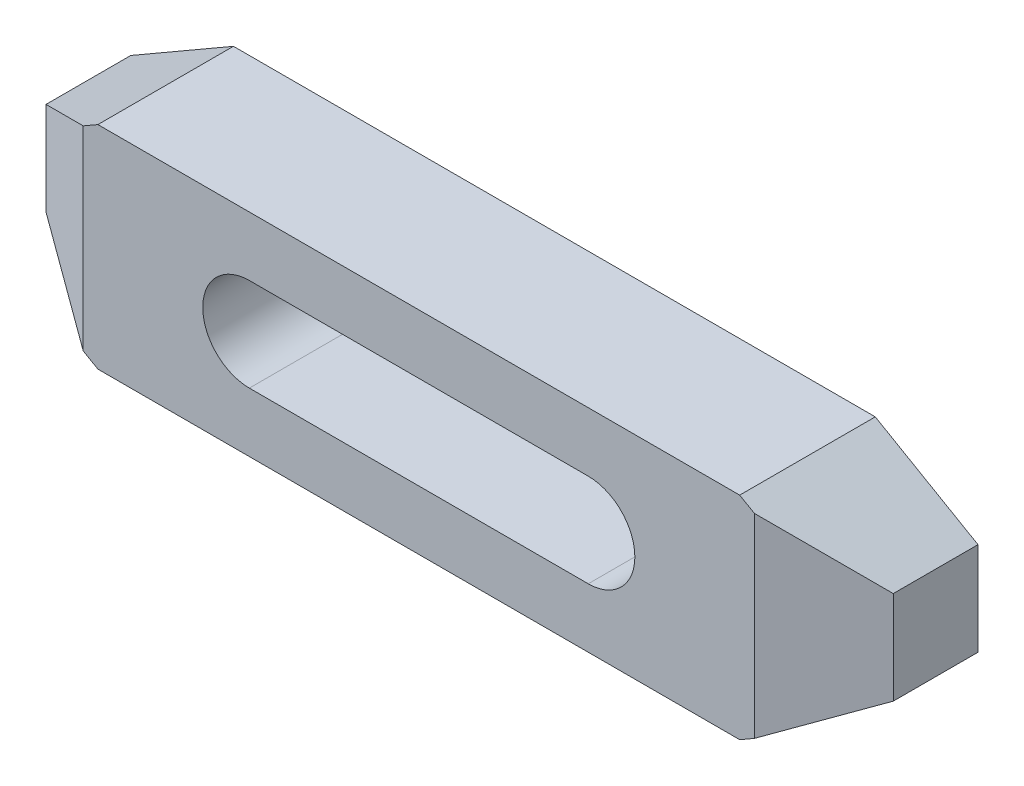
ISO-10303-21;
HEADER;
FILE_DESCRIPTION(('STEP AP214'),'2;1');
FILE_NAME('part.step','',(''),(''),'','','');
FILE_SCHEMA(('AUTOMOTIVE_DESIGN { 1 0 10303 214 1 1 1 1 }'));
ENDSEC;
DATA;
#1=APPLICATION_CONTEXT('core data for automotive mechanical design processes');
#2=APPLICATION_PROTOCOL_DEFINITION('international standard','automotive_design',2000,#1);
#3=PRODUCT_CONTEXT('',#1,'mechanical');
#4=PRODUCT('Part','Part','',(#3));
#5=PRODUCT_RELATED_PRODUCT_CATEGORY('part','',(#4));
#6=PRODUCT_DEFINITION_FORMATION('','',#4);
#7=PRODUCT_DEFINITION_CONTEXT('part definition',#1,'design');
#8=PRODUCT_DEFINITION('design','',#6,#7);
#9=PRODUCT_DEFINITION_SHAPE('','',#8);
#10=(LENGTH_UNIT() NAMED_UNIT(*) SI_UNIT(.MILLI.,.METRE.));
#11=(NAMED_UNIT(*) PLANE_ANGLE_UNIT() SI_UNIT($,.RADIAN.));
#12=(NAMED_UNIT(*) SI_UNIT($,.STERADIAN.) SOLID_ANGLE_UNIT());
#13=UNCERTAINTY_MEASURE_WITH_UNIT(LENGTH_MEASURE(1.E-05),#10,'distance_accuracy_value','');
#14=(GEOMETRIC_REPRESENTATION_CONTEXT(3) GLOBAL_UNCERTAINTY_ASSIGNED_CONTEXT((#13)) GLOBAL_UNIT_ASSIGNED_CONTEXT((#10,
#11,#12)) REPRESENTATION_CONTEXT('',''));
#15=CARTESIAN_POINT('',(0.,0.,0.));
#16=DIRECTION('',(0.,0.,1.));
#17=DIRECTION('',(1.,0.,0.));
#18=AXIS2_PLACEMENT_3D('',#15,#16,#17);
#19=CARTESIAN_POINT('',(0.,-34.3675134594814,16.));
#20=DIRECTION('',(0.,0.,-1.));
#21=DIRECTION('',(-1.,0.,0.));
#22=AXIS2_PLACEMENT_3D('',#19,#20,#21);
#23=PLANE('',#22);
#24=CARTESIAN_POINT('',(20.,0.,16.));
#25=DIRECTION('',(0.,0.,1.));
#26=DIRECTION('',(1.,0.,0.));
#27=AXIS2_PLACEMENT_3D('',#24,#25,#26);
#28=CIRCLE('',#27,5.5);
#29=CARTESIAN_POINT('',(20.,-5.5,16.));
#30=VERTEX_POINT('',#29);
#31=CARTESIAN_POINT('',(20.,5.5,16.));
#32=VERTEX_POINT('',#31);
#33=EDGE_CURVE('E221',#30,#32,#28,.T.);
#34=ORIENTED_EDGE('',*,*,#33,.F.);
#35=DIRECTION('',(-1.,0.,0.));
#36=VECTOR('',#35,1.);
#37=CARTESIAN_POINT('',(20.,-5.5,16.));
#38=LINE('',#37,#36);
#39=CARTESIAN_POINT('',(-20.,-5.5,16.));
#40=VERTEX_POINT('',#39);
#41=EDGE_CURVE('E220',#30,#40,#38,.T.);
#42=ORIENTED_EDGE('',*,*,#41,.T.);
#43=CARTESIAN_POINT('',(-20.,0.,16.));
#44=DIRECTION('',(0.,0.,1.));
#45=DIRECTION('',(1.,0.,0.));
#46=AXIS2_PLACEMENT_3D('',#43,#44,#45);
#47=CIRCLE('',#46,5.5);
#48=CARTESIAN_POINT('',(-20.,5.5,16.));
#49=VERTEX_POINT('',#48);
#50=EDGE_CURVE('E228',#49,#40,#47,.T.);
#51=ORIENTED_EDGE('',*,*,#50,.F.);
#52=DIRECTION('',(-1.,0.,0.));
#53=VECTOR('',#52,1.);
#54=CARTESIAN_POINT('',(20.,5.5,16.));
#55=LINE('',#54,#53);
#56=EDGE_CURVE('E224',#32,#49,#55,.T.);
#57=ORIENTED_EDGE('',*,*,#56,.F.);
#58=EDGE_LOOP('',(#34,#42,#51,#57));
#59=FACE_BOUND('',#58,.T.);
#60=DIRECTION('',(0.,1.,0.));
#61=VECTOR('',#60,1.);
#62=CARTESIAN_POINT('',(-39.6076951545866,-34.3675134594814,16.));
#63=LINE('',#62,#61);
#64=CARTESIAN_POINT('',(-39.6076951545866,-11.5,16.));
#65=VERTEX_POINT('',#64);
#66=CARTESIAN_POINT('',(-39.6076951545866,11.5,16.));
#67=VERTEX_POINT('',#66);
#68=EDGE_CURVE('E115',#65,#67,#63,.T.);
#69=ORIENTED_EDGE('',*,*,#68,.F.);
#70=DIRECTION('',(-0.866025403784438,0.5,0.));
#71=VECTOR('',#70,1.);
#72=CARTESIAN_POINT('',(-37.8756443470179,-12.5,16.));
#73=LINE('',#72,#71);
#74=CARTESIAN_POINT('',(-37.8756443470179,-12.5,16.));
#75=VERTEX_POINT('',#74);
#76=EDGE_CURVE('E174',#75,#65,#73,.T.);
#77=ORIENTED_EDGE('',*,*,#76,.F.);
#78=DIRECTION('',(-1.,0.,0.));
#79=VECTOR('',#78,1.);
#80=CARTESIAN_POINT('',(37.8756443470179,-12.5,16.));
#81=LINE('',#80,#79);
#82=CARTESIAN_POINT('',(37.8756443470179,-12.5,16.));
#83=VERTEX_POINT('',#82);
#84=EDGE_CURVE('E177',#83,#75,#81,.T.);
#85=ORIENTED_EDGE('',*,*,#84,.F.);
#86=DIRECTION('',(-0.866025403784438,-0.5,0.));
#87=VECTOR('',#86,1.);
#88=CARTESIAN_POINT('',(50.,-5.5,16.));
#89=LINE('',#88,#87);
#90=CARTESIAN_POINT('',(39.6076951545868,-11.5,16.));
#91=VERTEX_POINT('',#90);
#92=EDGE_CURVE('E157',#91,#83,#89,.T.);
#93=ORIENTED_EDGE('',*,*,#92,.F.);
#94=DIRECTION('',(0.,1.,0.));
#95=VECTOR('',#94,1.);
#96=CARTESIAN_POINT('',(39.6076951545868,-34.3675134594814,16.));
#97=LINE('',#96,#95);
#98=CARTESIAN_POINT('',(39.6076951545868,11.5,16.));
#99=VERTEX_POINT('',#98);
#100=EDGE_CURVE('E146',#91,#99,#97,.T.);
#101=ORIENTED_EDGE('',*,*,#100,.T.);
#102=DIRECTION('',(0.866025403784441,-0.5,0.));
#103=VECTOR('',#102,1.);
#104=CARTESIAN_POINT('',(37.8756443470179,12.5,16.));
#105=LINE('',#104,#103);
#106=CARTESIAN_POINT('',(37.8756443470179,12.5,16.));
#107=VERTEX_POINT('',#106);
#108=EDGE_CURVE('E155',#107,#99,#105,.T.);
#109=ORIENTED_EDGE('',*,*,#108,.F.);
#110=DIRECTION('',(1.,0.,0.));
#111=VECTOR('',#110,1.);
#112=CARTESIAN_POINT('',(-37.8756443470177,12.5,16.));
#113=LINE('',#112,#111);
#114=CARTESIAN_POINT('',(-37.8756443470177,12.5,16.));
#115=VERTEX_POINT('',#114);
#116=EDGE_CURVE('E164',#115,#107,#113,.T.);
#117=ORIENTED_EDGE('',*,*,#116,.F.);
#118=DIRECTION('',(0.866025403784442,0.5,0.));
#119=VECTOR('',#118,1.);
#120=CARTESIAN_POINT('',(-50.,5.5,16.));
#121=LINE('',#120,#119);
#122=EDGE_CURVE('E167',#67,#115,#121,.T.);
#123=ORIENTED_EDGE('',*,*,#122,.F.);
#124=EDGE_LOOP('',(#69,#77,#85,#93,#101,#109,#117,#123));
#125=FACE_BOUND('',#124,.T.);
#126=ADVANCED_FACE('F14',(#59,#125),#23,.F.);
#127=CARTESIAN_POINT('',(-50.,5.5,16.));
#128=DIRECTION('',(-0.5,0.866025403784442,0.));
#129=DIRECTION('',(-0.866025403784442,-0.5,0.));
#130=AXIS2_PLACEMENT_3D('',#127,#128,#129);
#131=PLANE('',#130);
#132=DIRECTION('',(0.,0.,-1.));
#133=VECTOR('',#132,1.);
#134=CARTESIAN_POINT('',(-50.,5.5,16.));
#135=LINE('',#134,#133);
#136=CARTESIAN_POINT('',(-50.,5.5,10.));
#137=VERTEX_POINT('',#136);
#138=CARTESIAN_POINT('',(-50.,5.5,0.));
#139=VERTEX_POINT('',#138);
#140=EDGE_CURVE('E124',#137,#139,#135,.T.);
#141=ORIENTED_EDGE('',*,*,#140,.F.);
#142=DIRECTION('',(0.774596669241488,0.447213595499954,0.447213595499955));
#143=VECTOR('',#142,1.);
#144=CARTESIAN_POINT('',(-47.9215390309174,6.7,11.2));
#145=LINE('',#144,#143);
#146=EDGE_CURVE('E112',#137,#67,#145,.T.);
#147=ORIENTED_EDGE('',*,*,#146,.T.);
#148=ORIENTED_EDGE('',*,*,#122,.T.);
#149=DIRECTION('',(0.,0.,-1.));
#150=VECTOR('',#149,1.);
#151=CARTESIAN_POINT('',(-37.8756443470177,12.5,16.));
#152=LINE('',#151,#150);
#153=CARTESIAN_POINT('',(-37.8756443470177,12.5,0.));
#154=VERTEX_POINT('',#153);
#155=EDGE_CURVE('E132',#115,#154,#152,.T.);
#156=ORIENTED_EDGE('',*,*,#155,.T.);
#157=DIRECTION('',(0.866025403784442,0.5,0.));
#158=VECTOR('',#157,1.);
#159=CARTESIAN_POINT('',(-50.,5.5,0.));
#160=LINE('',#159,#158);
#161=EDGE_CURVE('E131',#139,#154,#160,.T.);
#162=ORIENTED_EDGE('',*,*,#161,.F.);
#163=EDGE_LOOP('',(#141,#147,#148,#156,#162));
#164=FACE_BOUND('',#163,.T.);
#165=ADVANCED_FACE('F129',(#164),#131,.T.);
#166=CARTESIAN_POINT('',(-50.,-5.5,16.));
#167=DIRECTION('',(-1.,0.,0.));
#168=DIRECTION('',(0.,0.,1.));
#169=AXIS2_PLACEMENT_3D('',#166,#167,#168);
#170=PLANE('',#169);
#171=DIRECTION('',(0.,0.,-1.));
#172=VECTOR('',#171,1.);
#173=CARTESIAN_POINT('',(-50.,-5.5,16.));
#174=LINE('',#173,#172);
#175=CARTESIAN_POINT('',(-50.,-5.5,10.));
#176=VERTEX_POINT('',#175);
#177=CARTESIAN_POINT('',(-50.,-5.5,0.));
#178=VERTEX_POINT('',#177);
#179=EDGE_CURVE('E126',#176,#178,#174,.T.);
#180=ORIENTED_EDGE('',*,*,#179,.F.);
#181=DIRECTION('',(0.,1.,0.));
#182=VECTOR('',#181,1.);
#183=CARTESIAN_POINT('',(-50.,-13.,10.));
#184=LINE('',#183,#182);
#185=EDGE_CURVE('E29',#176,#137,#184,.T.);
#186=ORIENTED_EDGE('',*,*,#185,.T.);
#187=ORIENTED_EDGE('',*,*,#140,.T.);
#188=DIRECTION('',(0.,1.,0.));
#189=VECTOR('',#188,1.);
#190=CARTESIAN_POINT('',(-50.,-5.5,0.));
#191=LINE('',#190,#189);
#192=EDGE_CURVE('E199',#178,#139,#191,.T.);
#193=ORIENTED_EDGE('',*,*,#192,.F.);
#194=EDGE_LOOP('',(#180,#186,#187,#193));
#195=FACE_BOUND('',#194,.T.);
#196=ADVANCED_FACE('F122',(#195),#170,.T.);
#197=CARTESIAN_POINT('',(-37.8756443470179,-12.5,16.));
#198=DIRECTION('',(-0.5,-0.866025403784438,0.));
#199=DIRECTION('',(0.866025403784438,-0.5,0.));
#200=AXIS2_PLACEMENT_3D('',#197,#198,#199);
#201=PLANE('',#200);
#202=ORIENTED_EDGE('',*,*,#76,.T.);
#203=DIRECTION('',(-0.774596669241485,0.44721359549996,-0.447213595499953));
#204=VECTOR('',#203,1.);
#205=CARTESIAN_POINT('',(-38.2220545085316,-12.3,16.8));
#206=LINE('',#205,#204);
#207=EDGE_CURVE('E9',#65,#176,#206,.T.);
#208=ORIENTED_EDGE('',*,*,#207,.T.);
#209=ORIENTED_EDGE('',*,*,#179,.T.);
#210=DIRECTION('',(-0.866025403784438,0.5,0.));
#211=VECTOR('',#210,1.);
#212=CARTESIAN_POINT('',(-37.8756443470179,-12.5,0.));
#213=LINE('',#212,#211);
#214=CARTESIAN_POINT('',(-37.8756443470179,-12.5,0.));
#215=VERTEX_POINT('',#214);
#216=EDGE_CURVE('E195',#215,#178,#213,.T.);
#217=ORIENTED_EDGE('',*,*,#216,.F.);
#218=DIRECTION('',(0.,0.,-1.));
#219=VECTOR('',#218,1.);
#220=CARTESIAN_POINT('',(-37.8756443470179,-12.5,16.));
#221=LINE('',#220,#219);
#222=EDGE_CURVE('E136',#75,#215,#221,.T.);
#223=ORIENTED_EDGE('',*,*,#222,.F.);
#224=EDGE_LOOP('',(#202,#208,#209,#217,#223));
#225=FACE_BOUND('',#224,.T.);
#226=ADVANCED_FACE('F198',(#225),#201,.T.);
#227=CARTESIAN_POINT('',(0.,-34.3675134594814,0.));
#228=DIRECTION('',(0.,0.,-1.));
#229=DIRECTION('',(-1.,0.,0.));
#230=AXIS2_PLACEMENT_3D('',#227,#228,#229);
#231=PLANE('',#230);
#232=DIRECTION('',(-0.866025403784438,-0.5,0.));
#233=VECTOR('',#232,1.);
#234=CARTESIAN_POINT('',(50.,-5.5,0.));
#235=LINE('',#234,#233);
#236=CARTESIAN_POINT('',(50.,-5.5,0.));
#237=VERTEX_POINT('',#236);
#238=CARTESIAN_POINT('',(37.8756443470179,-12.5,0.));
#239=VERTEX_POINT('',#238);
#240=EDGE_CURVE('E170',#237,#239,#235,.T.);
#241=ORIENTED_EDGE('',*,*,#240,.T.);
#242=DIRECTION('',(-1.,0.,0.));
#243=VECTOR('',#242,1.);
#244=CARTESIAN_POINT('',(37.8756443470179,-12.5,0.));
#245=LINE('',#244,#243);
#246=EDGE_CURVE('E186',#239,#215,#245,.T.);
#247=ORIENTED_EDGE('',*,*,#246,.T.);
#248=ORIENTED_EDGE('',*,*,#216,.T.);
#249=ORIENTED_EDGE('',*,*,#192,.T.);
#250=ORIENTED_EDGE('',*,*,#161,.T.);
#251=DIRECTION('',(1.,0.,0.));
#252=VECTOR('',#251,1.);
#253=CARTESIAN_POINT('',(-37.8756443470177,12.5,0.));
#254=LINE('',#253,#252);
#255=CARTESIAN_POINT('',(37.8756443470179,12.5,0.));
#256=VERTEX_POINT('',#255);
#257=EDGE_CURVE('E204',#154,#256,#254,.T.);
#258=ORIENTED_EDGE('',*,*,#257,.T.);
#259=DIRECTION('',(0.866025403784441,-0.5,0.));
#260=VECTOR('',#259,1.);
#261=CARTESIAN_POINT('',(37.8756443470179,12.5,0.));
#262=LINE('',#261,#260);
#263=CARTESIAN_POINT('',(50.,5.50000000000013,0.));
#264=VERTEX_POINT('',#263);
#265=EDGE_CURVE('E207',#256,#264,#262,.T.);
#266=ORIENTED_EDGE('',*,*,#265,.T.);
#267=DIRECTION('',(0.,-1.,0.));
#268=VECTOR('',#267,1.);
#269=CARTESIAN_POINT('',(50.,5.50000000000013,0.));
#270=LINE('',#269,#268);
#271=EDGE_CURVE('E180',#264,#237,#270,.T.);
#272=ORIENTED_EDGE('',*,*,#271,.T.);
#273=EDGE_LOOP('',(#241,#247,#248,#249,#250,#258,#266,#272));
#274=FACE_BOUND('',#273,.T.);
#275=DIRECTION('',(-1.,0.,0.));
#276=VECTOR('',#275,1.);
#277=CARTESIAN_POINT('',(20.,-5.5,0.));
#278=LINE('',#277,#276);
#279=CARTESIAN_POINT('',(20.,-5.5,0.));
#280=VERTEX_POINT('',#279);
#281=CARTESIAN_POINT('',(-20.,-5.5,0.));
#282=VERTEX_POINT('',#281);
#283=EDGE_CURVE('E225',#280,#282,#278,.T.);
#284=ORIENTED_EDGE('',*,*,#283,.F.);
#285=CARTESIAN_POINT('',(20.,0.,0.));
#286=DIRECTION('',(0.,0.,1.));
#287=DIRECTION('',(1.,0.,0.));
#288=AXIS2_PLACEMENT_3D('',#285,#286,#287);
#289=CIRCLE('',#288,5.5);
#290=CARTESIAN_POINT('',(20.,5.5,0.));
#291=VERTEX_POINT('',#290);
#292=EDGE_CURVE('E232',#280,#291,#289,.T.);
#293=ORIENTED_EDGE('',*,*,#292,.T.);
#294=DIRECTION('',(-1.,0.,0.));
#295=VECTOR('',#294,1.);
#296=CARTESIAN_POINT('',(20.,5.5,0.));
#297=LINE('',#296,#295);
#298=CARTESIAN_POINT('',(-20.,5.5,0.));
#299=VERTEX_POINT('',#298);
#300=EDGE_CURVE('E235',#291,#299,#297,.T.);
#301=ORIENTED_EDGE('',*,*,#300,.T.);
#302=CARTESIAN_POINT('',(-20.,0.,0.));
#303=DIRECTION('',(0.,0.,1.));
#304=DIRECTION('',(1.,0.,0.));
#305=AXIS2_PLACEMENT_3D('',#302,#303,#304);
#306=CIRCLE('',#305,5.5);
#307=EDGE_CURVE('E238',#299,#282,#306,.T.);
#308=ORIENTED_EDGE('',*,*,#307,.T.);
#309=EDGE_LOOP('',(#284,#293,#301,#308));
#310=FACE_BOUND('',#309,.T.);
#311=ADVANCED_FACE('F193',(#274,#310),#231,.T.);
#312=CARTESIAN_POINT('',(50.,-5.5,16.));
#313=DIRECTION('',(0.5,-0.866025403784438,0.));
#314=DIRECTION('',(0.866025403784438,0.5,0.));
#315=AXIS2_PLACEMENT_3D('',#312,#313,#314);
#316=PLANE('',#315);
#317=DIRECTION('',(0.774596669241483,0.447213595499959,-0.447213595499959));
#318=VECTOR('',#317,1.);
#319=CARTESIAN_POINT('',(47.9215390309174,-6.7,11.2));
#320=LINE('',#319,#318);
#321=CARTESIAN_POINT('',(50.,-5.5,10.));
#322=VERTEX_POINT('',#321);
#323=EDGE_CURVE('E158',#91,#322,#320,.T.);
#324=ORIENTED_EDGE('',*,*,#323,.F.);
#325=ORIENTED_EDGE('',*,*,#92,.T.);
#326=DIRECTION('',(0.,0.,-1.));
#327=VECTOR('',#326,1.);
#328=CARTESIAN_POINT('',(37.8756443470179,-12.5,16.));
#329=LINE('',#328,#327);
#330=EDGE_CURVE('E163',#83,#239,#329,.T.);
#331=ORIENTED_EDGE('',*,*,#330,.T.);
#332=ORIENTED_EDGE('',*,*,#240,.F.);
#333=DIRECTION('',(0.,0.,-1.));
#334=VECTOR('',#333,1.);
#335=CARTESIAN_POINT('',(50.,-5.5,16.));
#336=LINE('',#335,#334);
#337=EDGE_CURVE('E143',#322,#237,#336,.T.);
#338=ORIENTED_EDGE('',*,*,#337,.F.);
#339=EDGE_LOOP('',(#324,#325,#331,#332,#338));
#340=FACE_BOUND('',#339,.T.);
#341=ADVANCED_FACE('F249',(#340),#316,.T.);
#342=CARTESIAN_POINT('',(50.,5.50000000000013,16.));
#343=DIRECTION('',(1.,0.,0.));
#344=DIRECTION('',(0.,0.,-1.));
#345=AXIS2_PLACEMENT_3D('',#342,#343,#344);
#346=PLANE('',#345);
#347=DIRECTION('',(0.,1.,0.));
#348=VECTOR('',#347,1.);
#349=CARTESIAN_POINT('',(50.,-13.,10.));
#350=LINE('',#349,#348);
#351=CARTESIAN_POINT('',(50.,5.50000000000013,10.));
#352=VERTEX_POINT('',#351);
#353=EDGE_CURVE('E36',#322,#352,#350,.T.);
#354=ORIENTED_EDGE('',*,*,#353,.F.);
#355=ORIENTED_EDGE('',*,*,#337,.T.);
#356=ORIENTED_EDGE('',*,*,#271,.F.);
#357=DIRECTION('',(0.,0.,-1.));
#358=VECTOR('',#357,1.);
#359=CARTESIAN_POINT('',(50.,5.50000000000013,16.));
#360=LINE('',#359,#358);
#361=EDGE_CURVE('E141',#352,#264,#360,.T.);
#362=ORIENTED_EDGE('',*,*,#361,.F.);
#363=EDGE_LOOP('',(#354,#355,#356,#362));
#364=FACE_BOUND('',#363,.T.);
#365=ADVANCED_FACE('F16',(#364),#346,.T.);
#366=CARTESIAN_POINT('',(37.8756443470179,12.5,16.));
#367=DIRECTION('',(0.5,0.866025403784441,0.));
#368=DIRECTION('',(-0.866025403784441,0.5,0.));
#369=AXIS2_PLACEMENT_3D('',#366,#367,#368);
#370=PLANE('',#369);
#371=DIRECTION('',(-0.774596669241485,0.447213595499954,0.44721359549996));
#372=VECTOR('',#371,1.);
#373=CARTESIAN_POINT('',(38.2220545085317,12.3,16.8));
#374=LINE('',#373,#372);
#375=EDGE_CURVE('E22',#352,#99,#374,.T.);
#376=ORIENTED_EDGE('',*,*,#375,.F.);
#377=ORIENTED_EDGE('',*,*,#361,.T.);
#378=ORIENTED_EDGE('',*,*,#265,.F.);
#379=DIRECTION('',(0.,0.,-1.));
#380=VECTOR('',#379,1.);
#381=CARTESIAN_POINT('',(37.8756443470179,12.5,16.));
#382=LINE('',#381,#380);
#383=EDGE_CURVE('E134',#107,#256,#382,.T.);
#384=ORIENTED_EDGE('',*,*,#383,.F.);
#385=ORIENTED_EDGE('',*,*,#108,.T.);
#386=EDGE_LOOP('',(#376,#377,#378,#384,#385));
#387=FACE_BOUND('',#386,.T.);
#388=ADVANCED_FACE('F160',(#387),#370,.T.);
#389=CARTESIAN_POINT('',(-37.8756443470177,12.5,16.));
#390=DIRECTION('',(0.,1.,0.));
#391=DIRECTION('',(0.,0.,1.));
#392=AXIS2_PLACEMENT_3D('',#389,#390,#391);
#393=PLANE('',#392);
#394=ORIENTED_EDGE('',*,*,#155,.F.);
#395=ORIENTED_EDGE('',*,*,#116,.T.);
#396=ORIENTED_EDGE('',*,*,#383,.T.);
#397=ORIENTED_EDGE('',*,*,#257,.F.);
#398=EDGE_LOOP('',(#394,#395,#396,#397));
#399=FACE_BOUND('',#398,.T.);
#400=ADVANCED_FACE('F253',(#399),#393,.T.);
#401=CARTESIAN_POINT('',(37.8756443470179,-12.5,16.));
#402=DIRECTION('',(0.,-1.,0.));
#403=DIRECTION('',(1.,0.,0.));
#404=AXIS2_PLACEMENT_3D('',#401,#402,#403);
#405=PLANE('',#404);
#406=ORIENTED_EDGE('',*,*,#84,.T.);
#407=ORIENTED_EDGE('',*,*,#222,.T.);
#408=ORIENTED_EDGE('',*,*,#246,.F.);
#409=ORIENTED_EDGE('',*,*,#330,.F.);
#410=EDGE_LOOP('',(#406,#407,#408,#409));
#411=FACE_BOUND('',#410,.T.);
#412=ADVANCED_FACE('F184',(#411),#405,.T.);
#413=CARTESIAN_POINT('',(20.,0.,16.));
#414=DIRECTION('',(0.,0.,-1.));
#415=DIRECTION('',(-1.,0.,0.));
#416=AXIS2_PLACEMENT_3D('',#413,#414,#415);
#417=CYLINDRICAL_SURFACE('',#416,5.5);
#418=DIRECTION('',(0.,0.,-1.));
#419=VECTOR('',#418,1.);
#420=CARTESIAN_POINT('',(20.,5.5,16.));
#421=LINE('',#420,#419);
#422=EDGE_CURVE('E211',#32,#291,#421,.T.);
#423=ORIENTED_EDGE('',*,*,#422,.T.);
#424=ORIENTED_EDGE('',*,*,#292,.F.);
#425=DIRECTION('',(0.,0.,-1.));
#426=VECTOR('',#425,1.);
#427=CARTESIAN_POINT('',(20.,-5.5,16.));
#428=LINE('',#427,#426);
#429=EDGE_CURVE('E217',#30,#280,#428,.T.);
#430=ORIENTED_EDGE('',*,*,#429,.F.);
#431=ORIENTED_EDGE('',*,*,#33,.T.);
#432=EDGE_LOOP('',(#423,#424,#430,#431));
#433=FACE_BOUND('',#432,.T.);
#434=ADVANCED_FACE('F261',(#433),#417,.F.);
#435=CARTESIAN_POINT('',(20.,5.5,16.));
#436=DIRECTION('',(0.,-1.,0.));
#437=DIRECTION('',(1.,0.,0.));
#438=AXIS2_PLACEMENT_3D('',#435,#436,#437);
#439=PLANE('',#438);
#440=DIRECTION('',(0.,0.,-1.));
#441=VECTOR('',#440,1.);
#442=CARTESIAN_POINT('',(-20.,5.5,16.));
#443=LINE('',#442,#441);
#444=EDGE_CURVE('E213',#49,#299,#443,.T.);
#445=ORIENTED_EDGE('',*,*,#444,.T.);
#446=ORIENTED_EDGE('',*,*,#300,.F.);
#447=ORIENTED_EDGE('',*,*,#422,.F.);
#448=ORIENTED_EDGE('',*,*,#56,.T.);
#449=EDGE_LOOP('',(#445,#446,#447,#448));
#450=FACE_BOUND('',#449,.T.);
#451=ADVANCED_FACE('F336',(#450),#439,.T.);
#452=CARTESIAN_POINT('',(-20.,0.,16.));
#453=DIRECTION('',(0.,0.,-1.));
#454=DIRECTION('',(-1.,0.,0.));
#455=AXIS2_PLACEMENT_3D('',#452,#453,#454);
#456=CYLINDRICAL_SURFACE('',#455,5.5);
#457=DIRECTION('',(0.,0.,-1.));
#458=VECTOR('',#457,1.);
#459=CARTESIAN_POINT('',(-20.,-5.5,16.));
#460=LINE('',#459,#458);
#461=EDGE_CURVE('E215',#40,#282,#460,.T.);
#462=ORIENTED_EDGE('',*,*,#461,.T.);
#463=ORIENTED_EDGE('',*,*,#307,.F.);
#464=ORIENTED_EDGE('',*,*,#444,.F.);
#465=ORIENTED_EDGE('',*,*,#50,.T.);
#466=EDGE_LOOP('',(#462,#463,#464,#465));
#467=FACE_BOUND('',#466,.T.);
#468=ADVANCED_FACE('F346',(#467),#456,.F.);
#469=CARTESIAN_POINT('',(20.,-5.5,16.));
#470=DIRECTION('',(0.,-1.,0.));
#471=DIRECTION('',(1.,0.,0.));
#472=AXIS2_PLACEMENT_3D('',#469,#470,#471);
#473=PLANE('',#472);
#474=ORIENTED_EDGE('',*,*,#41,.F.);
#475=ORIENTED_EDGE('',*,*,#429,.T.);
#476=ORIENTED_EDGE('',*,*,#283,.T.);
#477=ORIENTED_EDGE('',*,*,#461,.F.);
#478=EDGE_LOOP('',(#474,#475,#476,#477));
#479=FACE_BOUND('',#478,.T.);
#480=ADVANCED_FACE('F355',(#479),#473,.F.);
#481=CARTESIAN_POINT('',(50.,-13.,10.));
#482=DIRECTION('',(-0.5,0.,-0.866025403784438));
#483=DIRECTION('',(-0.866025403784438,0.,0.5));
#484=AXIS2_PLACEMENT_3D('',#481,#482,#483);
#485=PLANE('',#484);
#486=ORIENTED_EDGE('',*,*,#323,.T.);
#487=ORIENTED_EDGE('',*,*,#353,.T.);
#488=ORIENTED_EDGE('',*,*,#375,.T.);
#489=ORIENTED_EDGE('',*,*,#100,.F.);
#490=EDGE_LOOP('',(#486,#487,#488,#489));
#491=FACE_BOUND('',#490,.T.);
#492=ADVANCED_FACE('F145',(#491),#485,.F.);
#493=CARTESIAN_POINT('',(-50.,-13.,10.));
#494=DIRECTION('',(-0.5,0.,0.866025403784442));
#495=DIRECTION('',(0.866025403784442,0.,0.5));
#496=AXIS2_PLACEMENT_3D('',#493,#494,#495);
#497=PLANE('',#496);
#498=ORIENTED_EDGE('',*,*,#185,.F.);
#499=ORIENTED_EDGE('',*,*,#207,.F.);
#500=ORIENTED_EDGE('',*,*,#68,.T.);
#501=ORIENTED_EDGE('',*,*,#146,.F.);
#502=EDGE_LOOP('',(#498,#499,#500,#501));
#503=FACE_BOUND('',#502,.T.);
#504=ADVANCED_FACE('F113',(#503),#497,.T.);
#505=CLOSED_SHELL('',(#126,#165,#196,#226,#311,#341,#365,#388,#400,#412,#434,#451,#468,#480,
#492,#504));
#506=MANIFOLD_SOLID_BREP('B1',#505);
#507=ADVANCED_BREP_SHAPE_REPRESENTATION('',(#18,#506),#14);
#508=SHAPE_DEFINITION_REPRESENTATION(#9,#507);
ENDSEC;
END-ISO-10303-21;
